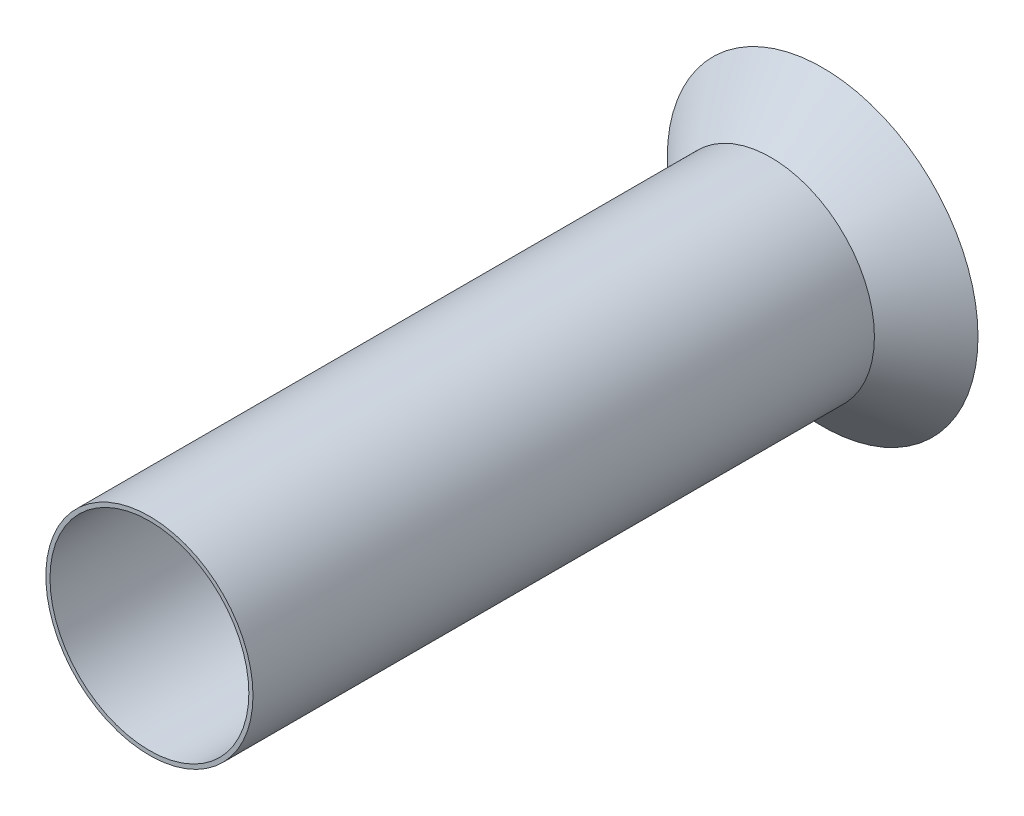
from build123d import *

# Parameters (mm, degrees)
SKIZZE1_R               = 50
LINEAR_AUSTRAGEN1_DEPTH = 300
SKIZZE1_2_R             = 50
SKIZZE2_R               = 75
WANDUNG1_T              = -2


with BuildPart() as part:
    # Skizze1 → Linear austragen1 (new body)
    with BuildSketch(Plane.XY):
        Circle(SKIZZE1_R)
    extrude(amount=LINEAR_AUSTRAGEN1_DEPTH)

    # Skizze1_2 → Ausformung1 section 0
    with BuildSketch(Plane.XY):
        Circle(SKIZZE1_2_R)
    # Skizze2 → Ausformung1 section 1
    with BuildSketch(Plane(origin=(0, 0, -25), x_dir=(-1, 0, 0), z_dir=(0, 0, -1))):
        Circle(SKIZZE2_R)
    loft()

    # Wandung1
    wandung1_openings = [part.faces().sort_by_distance(p)[0] for p in [
        (0, 0, 300),
        (0, 0, -25),
    ]]
    offset(amount=WANDUNG1_T, openings=wandung1_openings, kind=Kind.INTERSECTION)


solid = part.part
